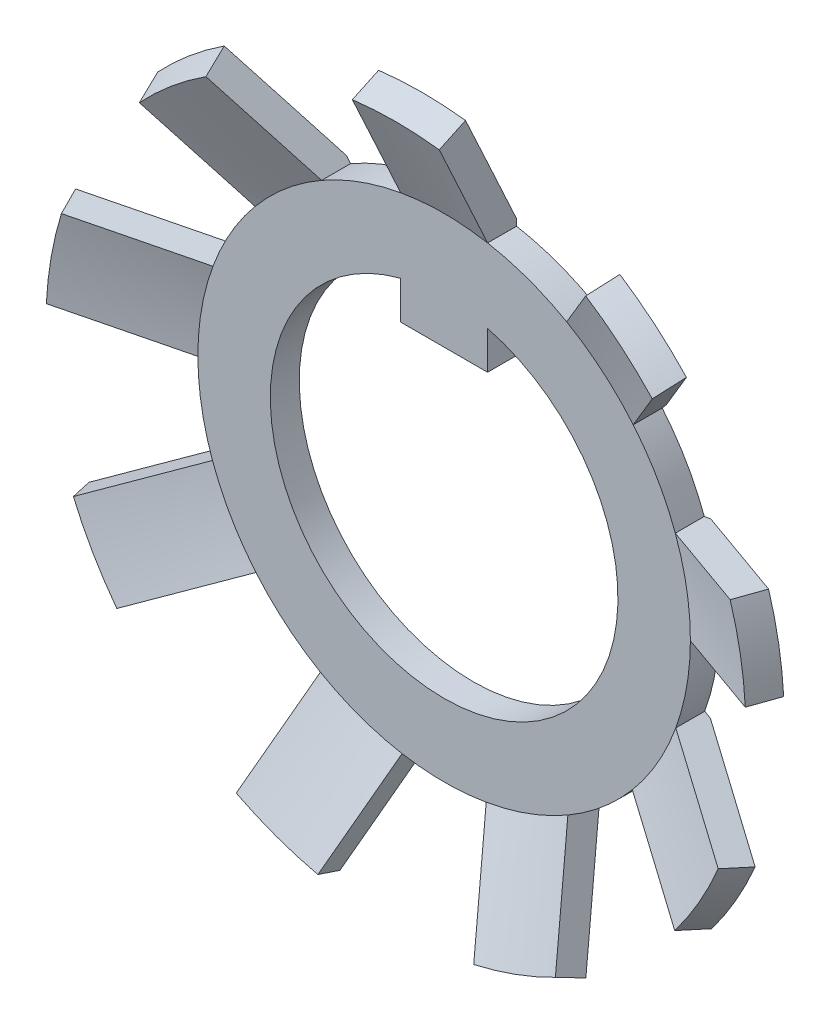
from build123d import *

# Parameters (mm, degrees)
BOSS_EXTRUDE1_DEPTH      = 1.5
BOSS_EXTRUDE1_DEPTH_BACK = 1.5
SKETCH3_R                = 25
CUT_EXTRUDE1_DEPTH       = 20


with BuildPart() as part:
    # Sketch1 → Revolve1 (revolve)
    with BuildSketch(Plane(origin=(0, 0, 0), x_dir=(0, 0, -1), z_dir=(1, 0, 0)), mode=Mode.PRIVATE) as revolve1_sk:
        Polygon((-2.668160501, 12.077381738), (-1, 8.5), (-1, 6), (0, 6), (0, 8.721694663), (-1.761852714, 12.5), align=None)
    revolve(revolve1_sk.sketch.rotate(Axis((0, 0, 0), (0, 0, 1)), 270), axis=Axis((0, 0, 0), (0, 0, 1)))

    # Sketch2 → Boss-Extrude1 (add, two sides: drawn at the far end of the back side and taken through both)
    with BuildSketch(Plane(origin=(0, 0, 0), x_dir=(0, 0, -1), z_dir=(1, 0, 0)).offset(-BOSS_EXTRUDE1_DEPTH_BACK)):
        Polygon((-1, 4.5), (1, 4.5), (1, 5.125), (0, 5.125), (0, 6), (-1, 6), align=None)
    extrude(amount=BOSS_EXTRUDE1_DEPTH + BOSS_EXTRUDE1_DEPTH_BACK)

    # Sketch3 → Cut-Extrude1 (cut)
    with BuildSketch(Plane.XY):
        Circle(SKETCH3_R)
        with BuildLine():
            Line((-12.481615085, 0.677705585), (-8.499965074, -0.02436674))
            ThreePointArc((-8.499965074, -0.02436674), (-8.370865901, -1.47600951), (-7.995688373, -2.884262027))
            Line((-7.995688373, -2.884262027), (-11.49709263, -4.905798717))
            ThreePointArc((-11.49709263, -4.905798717), (-10.825317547, -6.25), (-9.99709263, -7.503874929))
            Line((-9.99709263, -7.503874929), (-6.495688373, -5.482338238))
            ThreePointArc((-6.495688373, -5.482338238), (-5.463694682, -6.511377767), (-4.271084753, -7.349002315))
            Line((-4.271084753, -7.349002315), (-5.65389729, -11.148248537))
            ThreePointArc((-5.65389729, -11.148248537), (-4.275251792, -11.74615776), (-2.834819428, -12.174308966))
            Line((-2.834819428, -12.174308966), (-1.452006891, -8.375062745))
            ThreePointArc((-1.452006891, -8.375062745), (0, -8.5), (1.452006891, -8.375062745))
            Line((1.452006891, -8.375062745), (2.834819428, -12.174308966))
            ThreePointArc((2.834819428, -12.174308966), (4.275251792, -11.74615776), (5.65389729, -11.148248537))
            Line((5.65389729, -11.148248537), (4.271084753, -7.349002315))
            ThreePointArc((4.271084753, -7.349002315), (5.463694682, -6.511377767), (6.495688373, -5.482338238))
            Line((6.495688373, -5.482338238), (9.99709263, -7.503874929))
            ThreePointArc((9.99709263, -7.503874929), (10.825317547, -6.25), (11.49709263, -4.905798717))
            Line((11.49709263, -4.905798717), (7.995688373, -2.884262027))
            ThreePointArc((7.995688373, -2.884262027), (8.370865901, -1.47600951), (8.499965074, -0.02436674))
            Line((8.499965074, -0.02436674), (12.481615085, 0.677705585))
            ThreePointArc((12.481615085, 0.677705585), (12.310096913, 2.170602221), (11.960670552, 3.632128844))
            Line((11.960670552, 3.632128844), (7.979020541, 2.930056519))
            ThreePointArc((7.979020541, 2.930056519), (7.361215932, 4.25), (6.52701365, 5.445006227))
            Line((6.52701365, 5.445006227), (9.125851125, 8.542180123))
            ThreePointArc((9.125851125, 8.542180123), (8.034845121, 9.575555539), (6.827717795, 10.470542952))
            Line((6.827717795, 10.470542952), (4.228880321, 7.373369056))
            ThreePointArc((4.228880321, 7.373369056), (2.907171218, 7.987387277), (1.5, 8.366600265))
            Line((1.5, 8.366600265), (1.5, 12.409673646))
            ThreePointArc((1.5, 12.409673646), (0, 12.5), (-1.5, 12.409673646))
            Line((-1.5, 12.409673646), (-1.5, 8.366600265))
            ThreePointArc((-1.5, 8.366600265), (-2.907171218, 7.987387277), (-4.228880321, 7.373369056))
            Line((-4.228880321, 7.373369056), (-6.827717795, 10.470542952))
            ThreePointArc((-6.827717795, 10.470542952), (-8.034845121, 9.575555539), (-9.125851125, 8.542180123))
            Line((-9.125851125, 8.542180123), (-6.52701365, 5.445006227))
            ThreePointArc((-6.52701365, 5.445006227), (-7.361215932, 4.25), (-7.979020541, 2.930056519))
            Line((-7.979020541, 2.930056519), (-11.960670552, 3.632128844))
            ThreePointArc((-11.960670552, 3.632128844), (-12.310096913, 2.170602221), (-12.481615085, 0.677705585))
        make_face(mode=Mode.SUBTRACT)
    extrude(amount=CUT_EXTRUDE1_DEPTH, mode=Mode.SUBTRACT)


solid = part.part
